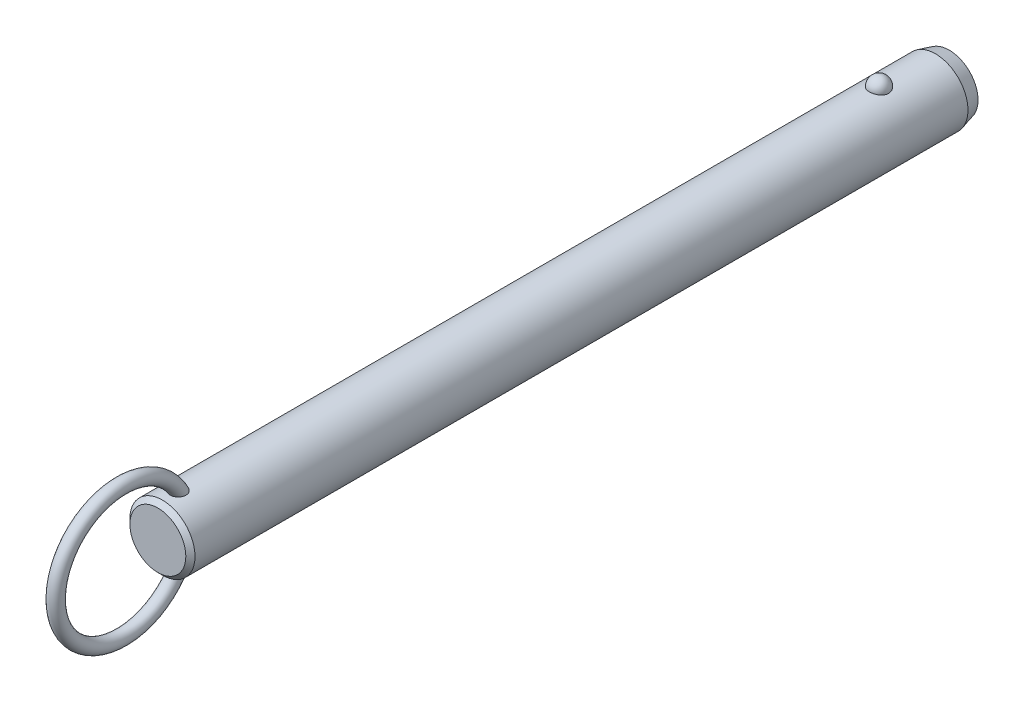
ISO-10303-21;
HEADER;
FILE_DESCRIPTION(('STEP AP214'),'2;1');
FILE_NAME('part.step','',(''),(''),'','','');
FILE_SCHEMA(('AUTOMOTIVE_DESIGN { 1 0 10303 214 1 1 1 1 }'));
ENDSEC;
DATA;
#1=APPLICATION_CONTEXT('core data for automotive mechanical design processes');
#2=APPLICATION_PROTOCOL_DEFINITION('international standard','automotive_design',2000,#1);
#3=PRODUCT_CONTEXT('',#1,'mechanical');
#4=PRODUCT('Part','Part','',(#3));
#5=PRODUCT_RELATED_PRODUCT_CATEGORY('part','',(#4));
#6=PRODUCT_DEFINITION_FORMATION('','',#4);
#7=PRODUCT_DEFINITION_CONTEXT('part definition',#1,'design');
#8=PRODUCT_DEFINITION('design','',#6,#7);
#9=PRODUCT_DEFINITION_SHAPE('','',#8);
#10=(LENGTH_UNIT() NAMED_UNIT(*) SI_UNIT(.MILLI.,.METRE.));
#11=(NAMED_UNIT(*) PLANE_ANGLE_UNIT() SI_UNIT($,.RADIAN.));
#12=(NAMED_UNIT(*) SI_UNIT($,.STERADIAN.) SOLID_ANGLE_UNIT());
#13=UNCERTAINTY_MEASURE_WITH_UNIT(LENGTH_MEASURE(1.E-05),#10,'distance_accuracy_value','');
#14=(GEOMETRIC_REPRESENTATION_CONTEXT(3) GLOBAL_UNCERTAINTY_ASSIGNED_CONTEXT((#13)) GLOBAL_UNIT_ASSIGNED_CONTEXT((#10,
#11,#12)) REPRESENTATION_CONTEXT('',''));
#15=CARTESIAN_POINT('',(0.,0.,0.));
#16=DIRECTION('',(0.,0.,1.));
#17=DIRECTION('',(1.,0.,0.));
#18=AXIS2_PLACEMENT_3D('',#15,#16,#17);
#19=CARTESIAN_POINT('',(0.,0.,147.3));
#20=DIRECTION('',(0.,0.,-1.));
#21=DIRECTION('',(-1.,0.,0.));
#22=AXIS2_PLACEMENT_3D('',#19,#20,#21);
#23=CYLINDRICAL_SURFACE('',#22,7.1);
#24=CARTESIAN_POINT('',(2.0769088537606,6.78943661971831,-2.1));
#25=CARTESIAN_POINT('',(2.07690739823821,6.78943796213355,-1.98268154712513));
#26=CARTESIAN_POINT('',(2.06738130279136,6.79237331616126,-1.86534506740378));
#27=CARTESIAN_POINT('',(2.0295040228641,6.8037853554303,-1.63400788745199));
#28=CARTESIAN_POINT('',(2.00114757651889,6.81226358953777,-1.52000812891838));
#29=CARTESIAN_POINT('',(1.92632025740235,6.83379798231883,-1.29863433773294));
#30=CARTESIAN_POINT('',(1.87985726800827,6.84685214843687,-1.19125744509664));
#31=CARTESIAN_POINT('',(1.76995205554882,6.87608091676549,-0.98604657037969));
#32=CARTESIAN_POINT('',(1.70650980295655,6.8922555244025,-0.88821260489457));
#33=CARTESIAN_POINT('',(1.5638119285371,6.92602930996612,-0.704242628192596));
#34=CARTESIAN_POINT('',(1.4844714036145,6.94363582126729,-0.618173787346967));
#35=CARTESIAN_POINT('',(1.31221746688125,6.97823658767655,-0.460740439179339));
#36=CARTESIAN_POINT('',(1.21930409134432,6.99523084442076,-0.389375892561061));
#37=CARTESIAN_POINT('',(1.02268781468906,7.02666176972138,-0.263547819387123));
#38=CARTESIAN_POINT('',(0.91902009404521,7.04110638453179,-0.209031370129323));
#39=CARTESIAN_POINT('',(0.703548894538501,7.06588726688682,-0.118163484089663));
#40=CARTESIAN_POINT('',(0.591746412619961,7.07622403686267,-0.0818098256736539));
#41=CARTESIAN_POINT('',(0.365557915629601,7.09147068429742,-0.0288711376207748));
#42=CARTESIAN_POINT('',(0.251267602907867,7.09648447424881,-0.0119070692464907));
#43=CARTESIAN_POINT('',(0.0213499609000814,7.10089837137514,0.00304925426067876));
#44=CARTESIAN_POINT('',(-0.0942772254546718,7.10029907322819,0.00104351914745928));
#45=CARTESIAN_POINT('',(-0.321651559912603,7.09360829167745,-0.0216931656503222));
#46=CARTESIAN_POINT('',(-0.433431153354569,7.08760388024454,-0.0421272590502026));
#47=CARTESIAN_POINT('',(-0.651862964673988,7.07086131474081,-0.100729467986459));
#48=CARTESIAN_POINT('',(-0.758515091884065,7.06012307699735,-0.138897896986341));
#49=CARTESIAN_POINT('',(-0.964449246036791,7.03496097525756,-0.232213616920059));
#50=CARTESIAN_POINT('',(-1.06368095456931,7.02051445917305,-0.287465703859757));
#51=CARTESIAN_POINT('',(-1.25145353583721,6.98948740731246,-0.413383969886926));
#52=CARTESIAN_POINT('',(-1.33999321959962,6.97290663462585,-0.48405186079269));
#53=CARTESIAN_POINT('',(-1.50591604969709,6.93898770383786,-0.640594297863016));
#54=CARTESIAN_POINT('',(-1.58302488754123,6.92164094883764,-0.726757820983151));
#55=CARTESIAN_POINT('',(-1.72189320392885,6.8884103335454,-0.91092752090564));
#56=CARTESIAN_POINT('',(-1.78365144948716,6.87252659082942,-1.008934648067));
#57=CARTESIAN_POINT('',(-1.89101272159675,6.84377189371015,-1.21549497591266));
#58=CARTESIAN_POINT('',(-1.93639553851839,6.83094274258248,-1.32416860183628));
#59=CARTESIAN_POINT('',(-2.00874275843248,6.81002070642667,-1.54791500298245));
#60=CARTESIAN_POINT('',(-2.03570774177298,6.80192767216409,-1.66298757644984));
#61=CARTESIAN_POINT('',(-2.07047276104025,6.7914266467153,-1.89571453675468));
#62=CARTESIAN_POINT('',(-2.07835878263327,6.78899315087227,-2.01335491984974));
#63=CARTESIAN_POINT('',(-2.07502083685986,6.79001409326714,-2.24833570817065));
#64=CARTESIAN_POINT('',(-2.06379746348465,6.7934683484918,-2.36567612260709));
#65=CARTESIAN_POINT('',(-2.02263913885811,6.80583442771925,-2.59603194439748));
#66=CARTESIAN_POINT('',(-1.99281127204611,6.81471501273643,-2.70906820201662));
#67=CARTESIAN_POINT('',(-1.91526639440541,6.83691232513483,-2.92836575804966));
#68=CARTESIAN_POINT('',(-1.8675486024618,6.85022924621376,-3.03462676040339));
#69=CARTESIAN_POINT('',(-1.75504492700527,6.87991336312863,-3.23806487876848));
#70=CARTESIAN_POINT('',(-1.69015924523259,6.89629822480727,-3.33518422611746));
#71=CARTESIAN_POINT('',(-1.54505404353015,6.93024852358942,-3.51697105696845));
#72=CARTESIAN_POINT('',(-1.46483385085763,6.94781401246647,-3.60163799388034));
#73=CARTESIAN_POINT('',(-1.29071406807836,6.98225977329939,-3.75654119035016));
#74=CARTESIAN_POINT('',(-1.19675650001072,6.99913673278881,-3.82671308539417));
#75=CARTESIAN_POINT('',(-0.997940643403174,7.03023618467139,-3.9501837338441));
#76=CARTESIAN_POINT('',(-0.89308318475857,7.04445887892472,-4.00348377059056));
#77=CARTESIAN_POINT('',(-0.676902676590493,7.06848365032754,-4.09107242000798));
#78=CARTESIAN_POINT('',(-0.565686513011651,7.0783430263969,-4.12560889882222));
#79=CARTESIAN_POINT('',(-0.338739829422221,7.09282534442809,-4.17575450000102));
#80=CARTESIAN_POINT('',(-0.223009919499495,7.09744899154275,-4.19136617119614));
#81=CARTESIAN_POINT('',(0.00707628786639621,7.10090930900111,-4.20307965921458));
#82=CARTESIAN_POINT('',(0.121410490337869,7.09986531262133,-4.19958377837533));
#83=CARTESIAN_POINT('',(0.347815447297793,7.092380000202,-4.17411564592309));
#84=CARTESIAN_POINT('',(0.459886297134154,7.08593891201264,-4.15214417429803));
#85=CARTESIAN_POINT('',(0.678084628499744,7.06838983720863,-4.09049562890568));
#86=CARTESIAN_POINT('',(0.784237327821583,7.05730369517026,-4.05090137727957));
#87=CARTESIAN_POINT('',(0.988305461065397,7.03163139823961,-3.95511447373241));
#88=CARTESIAN_POINT('',(1.08622031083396,7.01704499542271,-3.89892064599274));
#89=CARTESIAN_POINT('',(1.27284490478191,6.98562668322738,-3.77035541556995));
#90=CARTESIAN_POINT('',(1.36137372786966,6.96876135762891,-3.69772964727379));
#91=CARTESIAN_POINT('',(1.52509486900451,6.93477412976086,-3.53878279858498));
#92=CARTESIAN_POINT('',(1.60028496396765,6.91765218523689,-3.45245943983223));
#93=CARTESIAN_POINT('',(1.73681688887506,6.88465753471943,-3.26658774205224));
#94=CARTESIAN_POINT('',(1.79785966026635,6.86881574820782,-3.16681408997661));
#95=CARTESIAN_POINT('',(1.90265327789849,6.84053157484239,-2.95814408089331));
#96=CARTESIAN_POINT('',(1.94640861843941,6.82808830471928,-2.84925010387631));
#97=CARTESIAN_POINT('',(2.01274378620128,6.80881460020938,-2.63454318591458));
#98=CARTESIAN_POINT('',(2.03676193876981,6.80160856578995,-2.52920574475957));
#99=CARTESIAN_POINT('',(2.06884490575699,6.79191902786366,-2.3159172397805));
#100=CARTESIAN_POINT('',(2.07691019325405,6.78943538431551,-2.20796625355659));
#101=CARTESIAN_POINT('',(2.0769088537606,6.78943661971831,-2.1));
#102=B_SPLINE_CURVE_WITH_KNOTS('',3,(#24,#25,#26,#27,#28,#29,#30,#31,#32,#33,#34,#35,#36,#37,
#38,#39,#40,#41,#42,#43,#44,#45,#46,#47,#48,#49,#50,#51,#52,#53,#54,#55,#56,#57,#58,#59,#60,#61,
#62,#63,#64,#65,#66,#67,#68,#69,#70,#71,#72,#73,#74,#75,#76,#77,#78,#79,#80,#81,#82,#83,#84,#85,
#86,#87,#88,#89,#90,#91,#92,#93,#94,#95,#96,#97,#98,#99,#100,#101),.UNSPECIFIED.,.T.,.F.,(4,2,2,
2,2,2,2,2,2,2,2,2,2,2,2,2,2,2,2,2,2,2,2,2,2,2,2,2,2,2,2,2,2,2,2,2,2,2,4),(0.,0.351568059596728,
0.703234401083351,1.05474780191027,1.40626181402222,1.75970563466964,2.11314851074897,
2.4654696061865,2.81774759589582,3.16301449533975,3.50824481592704,3.84801136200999,
4.18778391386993,4.52968352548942,4.87162112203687,5.22076181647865,5.56993054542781,
5.92363364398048,6.27732559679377,6.62942052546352,6.98150450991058,7.33158042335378,
7.68167162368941,8.03384443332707,8.38603269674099,8.73975272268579,9.09344583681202,
9.44234545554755,9.79119807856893,10.1327344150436,10.4742563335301,10.8141898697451,
11.1541474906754,11.4997793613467,11.8454687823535,12.1979079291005,12.5502553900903,
12.8738073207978,13.1973496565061),.UNSPECIFIED.);
#103=CARTESIAN_POINT('',(2.0769088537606,6.78943661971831,-2.1));
#104=VERTEX_POINT('',#103);
#105=EDGE_CURVE('E41',#104,#104,#102,.T.);
#106=ORIENTED_EDGE('',*,*,#105,.T.);
#107=EDGE_LOOP('',(#106));
#108=FACE_BOUND('',#107,.T.);
#109=CARTESIAN_POINT('',(0.,0.,154.22));
#110=DIRECTION('',(0.,0.,1.));
#111=DIRECTION('',(1.,0.,0.));
#112=AXIS2_PLACEMENT_3D('',#109,#110,#111);
#113=CIRCLE('',#112,7.1);
#114=CARTESIAN_POINT('',(7.1,0.,154.22));
#115=VERTEX_POINT('',#114);
#116=EDGE_CURVE('E10',#115,#115,#113,.F.);
#117=ORIENTED_EDGE('',*,*,#116,.T.);
#118=EDGE_LOOP('',(#117));
#119=FACE_BOUND('',#118,.T.);
#120=CARTESIAN_POINT('',(-0.429539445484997,-7.08699541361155,149.042921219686));
#121=CARTESIAN_POINT('',(-0.508331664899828,-7.08221999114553,149.066876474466));
#122=CARTESIAN_POINT('',(-0.585039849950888,-7.07624016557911,149.097457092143));
#123=CARTESIAN_POINT('',(-0.73208265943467,-7.06254296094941,149.171024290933));
#124=CARTESIAN_POINT('',(-0.802417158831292,-7.05482554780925,149.214011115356));
#125=CARTESIAN_POINT('',(-0.934722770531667,-7.03851844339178,149.311113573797));
#126=CARTESIAN_POINT('',(-0.996700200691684,-7.02992941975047,149.365220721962));
#127=CARTESIAN_POINT('',(-1.11079942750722,-7.01280697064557,149.482967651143));
#128=CARTESIAN_POINT('',(-1.16292136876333,-7.00427354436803,149.546607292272));
#129=CARTESIAN_POINT('',(-1.25705660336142,-6.98799959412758,149.682687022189));
#130=CARTESIAN_POINT('',(-1.29888032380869,-6.98027525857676,149.755259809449));
#131=CARTESIAN_POINT('',(-1.37069920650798,-6.96652886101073,149.906168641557));
#132=CARTESIAN_POINT('',(-1.40069157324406,-6.96050720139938,149.984506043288));
#133=CARTESIAN_POINT('',(-1.45043507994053,-6.95031881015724,150.150190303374));
#134=CARTESIAN_POINT('',(-1.46937115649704,-6.94630231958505,150.237789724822));
#135=CARTESIAN_POINT('',(-1.49424917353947,-6.94099239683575,150.414871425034));
#136=CARTESIAN_POINT('',(-1.50018601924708,-6.93970003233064,150.504354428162));
#137=CARTESIAN_POINT('',(-1.49978214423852,-6.93978815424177,150.694060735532));
#138=CARTESIAN_POINT('',(-1.49187639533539,-6.94150934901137,150.794279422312));
#139=CARTESIAN_POINT('',(-1.46177925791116,-6.94790814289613,150.992479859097));
#140=CARTESIAN_POINT('',(-1.43957541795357,-6.95258831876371,151.090459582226));
#141=CARTESIAN_POINT('',(-1.37783293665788,-6.96510647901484,151.29536292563));
#142=CARTESIAN_POINT('',(-1.33634073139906,-6.97328848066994,151.401680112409));
#143=CARTESIAN_POINT('',(-1.23686994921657,-6.99161706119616,151.606177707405));
#144=CARTESIAN_POINT('',(-1.17889192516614,-7.00176357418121,151.704358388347));
#145=CARTESIAN_POINT('',(-1.0587512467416,-7.02082898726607,151.872374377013));
#146=CARTESIAN_POINT('',(-0.999247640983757,-7.02963746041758,151.944123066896));
#147=CARTESIAN_POINT('',(-0.869494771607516,-7.04686074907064,152.077195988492));
#148=CARTESIAN_POINT('',(-0.799263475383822,-7.05527619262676,152.138537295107));
#149=CARTESIAN_POINT('',(-0.665408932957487,-7.06899457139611,152.235131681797));
#150=CARTESIAN_POINT('',(-0.603817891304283,-7.07457275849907,152.273151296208));
#151=CARTESIAN_POINT('',(-0.475172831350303,-7.08437420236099,152.338758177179));
#152=CARTESIAN_POINT('',(-0.408123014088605,-7.08859848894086,152.366353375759));
#153=CARTESIAN_POINT('',(-0.269431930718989,-7.09522749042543,152.409256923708));
#154=CARTESIAN_POINT('',(-0.197757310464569,-7.09761688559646,152.424461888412));
#155=CARTESIAN_POINT('',(-0.0527849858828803,-7.10017268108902,152.440716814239));
#156=CARTESIAN_POINT('',(0.0205115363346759,-7.10034065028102,152.441776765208));
#157=CARTESIAN_POINT('',(0.156426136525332,-7.09855986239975,152.430461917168));
#158=CARTESIAN_POINT('',(0.219199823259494,-7.09688191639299,152.419806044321));
#159=CARTESIAN_POINT('',(0.342134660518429,-7.09201880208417,152.388537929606));
#160=CARTESIAN_POINT('',(0.402295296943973,-7.08883333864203,152.367923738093));
#161=CARTESIAN_POINT('',(0.520687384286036,-7.08113868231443,152.317212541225));
#162=CARTESIAN_POINT('',(0.578791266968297,-7.07658958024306,152.286827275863));
#163=CARTESIAN_POINT('',(0.690173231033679,-7.06659708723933,152.218367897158));
#164=CARTESIAN_POINT('',(0.743447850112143,-7.061153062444,152.180288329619));
#165=CARTESIAN_POINT('',(0.870947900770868,-7.04680292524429,152.076592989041));
#166=CARTESIAN_POINT('',(0.941828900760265,-7.03755800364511,152.006897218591));
#167=CARTESIAN_POINT('',(1.07136606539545,-7.01900793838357,151.856945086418));
#168=CARTESIAN_POINT('',(1.13000013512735,-7.00970271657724,151.776670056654));
#169=CARTESIAN_POINT('',(1.23579584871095,-6.99183327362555,151.606899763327));
#170=CARTESIAN_POINT('',(1.28274271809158,-6.98328455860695,151.517269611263));
#171=CARTESIAN_POINT('',(1.36351442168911,-6.96796352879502,151.332176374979));
#172=CARTESIAN_POINT('',(1.39733971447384,-6.96119115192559,151.236713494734));
#173=CARTESIAN_POINT('',(1.45579181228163,-6.94922464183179,151.02530928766));
#174=CARTESIAN_POINT('',(1.47790145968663,-6.94449000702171,150.908631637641));
#175=CARTESIAN_POINT('',(1.50168752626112,-6.93938731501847,150.673015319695));
#176=CARTESIAN_POINT('',(1.50336085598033,-6.93901991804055,150.55407631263));
#177=CARTESIAN_POINT('',(1.48486516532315,-6.9430010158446,150.32360799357));
#178=CARTESIAN_POINT('',(1.46573441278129,-6.9471253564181,150.211995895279));
#179=CARTESIAN_POINT('',(1.40606892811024,-6.95944667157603,149.994886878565));
#180=CARTESIAN_POINT('',(1.36556446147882,-6.96763788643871,149.8893815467));
#181=CARTESIAN_POINT('',(1.2708270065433,-6.98548038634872,149.704287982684));
#182=CARTESIAN_POINT('',(1.21949810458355,-6.99473841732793,149.623171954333));
#183=CARTESIAN_POINT('',(1.10242050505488,-7.01414069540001,149.472227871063));
#184=CARTESIAN_POINT('',(1.03668119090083,-7.02428436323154,149.40239252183));
#185=CARTESIAN_POINT('',(0.900559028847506,-7.04295285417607,149.283573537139));
#186=CARTESIAN_POINT('',(0.831428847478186,-7.05153466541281,149.233157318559));
#187=CARTESIAN_POINT('',(0.685291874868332,-7.06723150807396,149.145142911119));
#188=CARTESIAN_POINT('',(0.608287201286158,-7.07434693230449,149.107541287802));
#189=CARTESIAN_POINT('',(0.451878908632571,-7.08602232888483,149.047491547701));
#190=CARTESIAN_POINT('',(0.372686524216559,-7.09067127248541,149.024508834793));
#191=CARTESIAN_POINT('',(0.21147739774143,-7.09730788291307,148.992035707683));
#192=CARTESIAN_POINT('',(0.129460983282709,-7.09929585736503,148.98254373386));
#193=CARTESIAN_POINT('',(-0.0332905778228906,-7.10037858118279,148.977351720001));
#194=CARTESIAN_POINT('',(-0.114016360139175,-7.09953334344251,148.981365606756));
#195=CARTESIAN_POINT('',(-0.273670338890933,-7.09517338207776,149.002454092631));
#196=CARTESIAN_POINT('',(-0.352598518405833,-7.09165863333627,149.019528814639));
#197=CARTESIAN_POINT('',(-0.429539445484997,-7.08699541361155,149.042921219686));
#198=B_SPLINE_CURVE_WITH_KNOTS('',3,(#120,#121,#122,#123,#124,#125,#126,#127,#128,#129,#130,
#131,#132,#133,#134,#135,#136,#137,#138,#139,#140,#141,#142,#143,#144,#145,#146,#147,#148,#149,
#150,#151,#152,#153,#154,#155,#156,#157,#158,#159,#160,#161,#162,#163,#164,#165,#166,#167,#168,
#169,#170,#171,#172,#173,#174,#175,#176,#177,#178,#179,#180,#181,#182,#183,#184,#185,#186,#187,
#188,#189,#190,#191,#192,#193,#194,#195,#196,#197),.UNSPECIFIED.,.T.,.F.,(4,2,2,2,2,2,2,2,2,2,2,
2,2,2,2,2,2,2,2,2,2,2,2,2,2,2,2,2,2,2,2,2,2,2,2,2,2,2,4),(0.,0.247183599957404,
0.494372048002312,0.741372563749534,0.988369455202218,1.23962059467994,1.490931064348,
1.75897818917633,2.02713035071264,2.32758265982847,2.62829697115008,2.97008736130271,
3.31186629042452,3.59175319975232,3.87117637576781,4.08813841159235,4.30493502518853,
4.5235225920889,4.74195577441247,4.93215328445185,5.12238804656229,5.31884850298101,
5.51544871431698,5.81332317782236,6.11173048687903,6.41527266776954,6.71880423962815,
7.07358156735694,7.42841252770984,7.76631485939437,8.10373999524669,8.39142246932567,
8.67891817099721,8.93560332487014,9.19221962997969,9.43881106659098,9.68537399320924,
9.9267475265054,10.1681233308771),.UNSPECIFIED.);
#199=CARTESIAN_POINT('',(-0.429539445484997,-7.08699541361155,149.042921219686));
#200=VERTEX_POINT('',#199);
#201=EDGE_CURVE('E60',#200,#200,#198,.T.);
#202=ORIENTED_EDGE('',*,*,#201,.T.);
#203=EDGE_LOOP('',(#202));
#204=FACE_BOUND('',#203,.T.);
#205=CARTESIAN_POINT('',(-0.429539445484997,7.08699541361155,149.042921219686));
#206=CARTESIAN_POINT('',(-0.351665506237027,7.09171429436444,149.019246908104));
#207=CARTESIAN_POINT('',(-0.271733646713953,7.09525896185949,149.002036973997));
#208=CARTESIAN_POINT('',(-0.110026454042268,7.09960839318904,148.981005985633));
#209=CARTESIAN_POINT('',(-0.0282502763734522,7.10041187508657,148.977191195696));
#210=CARTESIAN_POINT('',(0.134782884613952,7.09918849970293,148.983059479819));
#211=CARTESIAN_POINT('',(0.216039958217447,7.09716214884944,148.99274013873));
#212=CARTESIAN_POINT('',(0.375730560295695,7.09050177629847,149.025347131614));
#213=CARTESIAN_POINT('',(0.454164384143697,7.08586802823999,149.048272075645));
#214=CARTESIAN_POINT('',(0.606025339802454,7.07449911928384,149.106771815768));
#215=CARTESIAN_POINT('',(0.67945100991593,7.06776334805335,149.142350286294));
#216=CARTESIAN_POINT('',(0.819234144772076,7.05292866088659,149.225175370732));
#217=CARTESIAN_POINT('',(0.88559181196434,7.04482978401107,149.272421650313));
#218=CARTESIAN_POINT('',(1.00993211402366,7.02808709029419,149.377590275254));
#219=CARTESIAN_POINT('',(1.06785399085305,7.01943990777,149.435583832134));
#220=CARTESIAN_POINT('',(1.17342527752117,7.00256662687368,149.560301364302));
#221=CARTESIAN_POINT('',(1.22107408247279,6.99434055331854,149.627025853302));
#222=CARTESIAN_POINT('',(1.30652927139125,6.97889183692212,149.769362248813));
#223=CARTESIAN_POINT('',(1.34399711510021,6.97170674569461,149.845180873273));
#224=CARTESIAN_POINT('',(1.40682616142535,6.95930080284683,150.001810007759));
#225=CARTESIAN_POINT('',(1.43218374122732,6.95408053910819,150.08262200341));
#226=CARTESIAN_POINT('',(1.47246409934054,6.94566853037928,150.253531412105));
#227=CARTESIAN_POINT('',(1.48642590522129,6.9426653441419,150.34386307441));
#228=CARTESIAN_POINT('',(1.5011410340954,6.93949744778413,150.525619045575));
#229=CARTESIAN_POINT('',(1.50188917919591,6.93933385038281,150.617043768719));
#230=CARTESIAN_POINT('',(1.49030464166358,6.94183245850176,150.81084381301));
#231=CARTESIAN_POINT('',(1.47627413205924,6.94486147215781,150.913112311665));
#232=CARTESIAN_POINT('',(1.43356351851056,6.95380194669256,151.114471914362));
#233=CARTESIAN_POINT('',(1.4048676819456,6.95971650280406,151.213559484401));
#234=CARTESIAN_POINT('',(1.32908750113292,6.97461208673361,151.418908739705));
#235=CARTESIAN_POINT('',(1.28011435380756,6.98388945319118,151.524456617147));
#236=CARTESIAN_POINT('',(1.16520357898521,7.00397743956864,151.725760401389));
#237=CARTESIAN_POINT('',(1.09927694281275,7.01478706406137,151.821522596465));
#238=CARTESIAN_POINT('',(0.969361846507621,7.03373936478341,151.976756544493));
#239=CARTESIAN_POINT('',(0.909042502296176,7.04187023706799,152.039303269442));
#240=CARTESIAN_POINT('',(0.779178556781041,7.05741732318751,152.154053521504));
#241=CARTESIAN_POINT('',(0.709649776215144,7.06483472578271,152.206274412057));
#242=CARTESIAN_POINT('',(0.576854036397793,7.0767751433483,152.288113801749));
#243=CARTESIAN_POINT('',(0.515118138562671,7.08158033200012,152.320164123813));
#244=CARTESIAN_POINT('',(0.387127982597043,7.08972701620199,152.373765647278));
#245=CARTESIAN_POINT('',(0.320877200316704,7.09306962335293,152.395324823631));
#246=CARTESIAN_POINT('',(0.185041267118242,7.09791507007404,152.426400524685));
#247=CARTESIAN_POINT('',(0.115437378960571,7.09940591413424,152.435838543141));
#248=CARTESIAN_POINT('',(-0.0243157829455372,7.10030171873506,152.441522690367));
#249=CARTESIAN_POINT('',(-0.0944648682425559,7.0997073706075,152.437773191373));
#250=CARTESIAN_POINT('',(-0.225713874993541,7.09668414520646,152.418508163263));
#251=CARTESIAN_POINT('',(-0.287006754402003,7.09444865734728,152.404232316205));
#252=CARTESIAN_POINT('',(-0.406555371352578,7.08860360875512,152.366368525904));
#253=CARTESIAN_POINT('',(-0.464809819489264,7.08499346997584,152.342776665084));
#254=CARTESIAN_POINT('',(-0.594955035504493,7.07541654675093,152.278923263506));
#255=CARTESIAN_POINT('',(-0.665389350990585,7.06906574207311,152.235753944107));
#256=CARTESIAN_POINT('',(-0.798242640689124,7.05530261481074,152.138587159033));
#257=CARTESIAN_POINT('',(-0.860645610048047,7.0478882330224,152.084568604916));
#258=CARTESIAN_POINT('',(-0.994249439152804,7.03045217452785,151.950996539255));
#259=CARTESIAN_POINT('',(-1.06260129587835,7.02030745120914,151.868614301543));
#260=CARTESIAN_POINT('',(-1.18502045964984,7.00068382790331,151.693843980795));
#261=CARTESIAN_POINT('',(-1.23907684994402,6.99120544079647,151.601448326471));
#262=CARTESIAN_POINT('',(-1.33335589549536,6.97384343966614,151.408008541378));
#263=CARTESIAN_POINT('',(-1.37336138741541,6.96598557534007,151.306856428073));
#264=CARTESIAN_POINT('',(-1.43770677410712,6.9529905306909,151.099504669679));
#265=CARTESIAN_POINT('',(-1.46204473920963,6.94785368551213,150.99330440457));
#266=CARTESIAN_POINT('',(-1.49537533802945,6.94076296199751,150.768231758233));
#267=CARTESIAN_POINT('',(-1.50273564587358,6.93914842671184,150.64909751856));
#268=CARTESIAN_POINT('',(-1.4954555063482,6.94072368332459,150.411470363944));
#269=CARTESIAN_POINT('',(-1.48082914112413,6.94391040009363,150.292977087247));
#270=CARTESIAN_POINT('',(-1.43076401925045,6.95438579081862,150.073432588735));
#271=CARTESIAN_POINT('',(-1.39762227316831,6.96121852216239,149.971841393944));
#272=CARTESIAN_POINT('',(-1.31211274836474,6.97783941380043,149.777351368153));
#273=CARTESIAN_POINT('',(-1.25976607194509,6.98762432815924,149.68444313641));
#274=CARTESIAN_POINT('',(-1.14583073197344,7.00713153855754,149.524160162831));
#275=CARTESIAN_POINT('',(-1.08665947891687,7.01665982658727,149.455035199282));
#276=CARTESIAN_POINT('',(-0.956606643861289,7.03556646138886,149.328878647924));
#277=CARTESIAN_POINT('',(-0.885737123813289,7.04494495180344,149.271834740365));
#278=CARTESIAN_POINT('',(-0.751558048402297,7.06035735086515,149.183100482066));
#279=CARTESIAN_POINT('',(-0.69012057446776,7.0666695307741,149.148593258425));
#280=CARTESIAN_POINT('',(-0.562815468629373,7.07794609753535,149.088750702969));
#281=CARTESIAN_POINT('',(-0.496948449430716,7.08291067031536,149.063414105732));
#282=CARTESIAN_POINT('',(-0.429539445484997,7.08699541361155,149.042921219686));
#283=B_SPLINE_CURVE_WITH_KNOTS('',3,(#205,#206,#207,#208,#209,#210,#211,#212,#213,#214,#215,
#216,#217,#218,#219,#220,#221,#222,#223,#224,#225,#226,#227,#228,#229,#230,#231,#232,#233,#234,
#235,#236,#237,#238,#239,#240,#241,#242,#243,#244,#245,#246,#247,#248,#249,#250,#251,#252,#253,
#254,#255,#256,#257,#258,#259,#260,#261,#262,#263,#264,#265,#266,#267,#268,#269,#270,#271,#272,
#273,#274,#275,#276,#277,#278,#279,#280,#281,#282),.UNSPECIFIED.,.T.,.F.,(4,2,2,2,2,2,2,2,2,2,2,
2,2,2,2,2,2,2,2,2,2,2,2,2,2,2,2,2,2,2,2,2,2,2,2,2,2,2,4),(0.,0.244335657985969,
0.488785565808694,0.733191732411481,0.977572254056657,1.2220237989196,1.46646834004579,
1.71259457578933,1.9587352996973,2.21226768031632,2.46587585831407,2.73913816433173,
3.01250754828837,3.32109936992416,3.63002293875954,3.9786351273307,4.32702187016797,
4.58793945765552,4.84841449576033,5.05676704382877,5.26496096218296,5.47449661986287,
5.68396281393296,5.87205447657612,6.06022532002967,6.30743751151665,6.55513496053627,
6.87602468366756,7.1971587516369,7.52305774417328,7.84899686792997,8.2051615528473,
8.56109821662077,8.88040084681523,9.19935367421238,9.47236282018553,9.74509220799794,
9.95662250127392,10.1681235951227),.UNSPECIFIED.);
#284=CARTESIAN_POINT('',(-0.429539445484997,7.08699541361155,149.042921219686));
#285=VERTEX_POINT('',#284);
#286=EDGE_CURVE('E67',#285,#285,#283,.T.);
#287=ORIENTED_EDGE('',*,*,#286,.T.);
#288=EDGE_LOOP('',(#287));
#289=FACE_BOUND('',#288,.T.);
#290=CARTESIAN_POINT('',(0.,0.,-14.4));
#291=DIRECTION('',(0.,0.,-1.));
#292=DIRECTION('',(-1.,0.,0.));
#293=AXIS2_PLACEMENT_3D('',#290,#291,#292);
#294=CIRCLE('',#293,7.1);
#295=CARTESIAN_POINT('',(-7.1,0.,-14.4));
#296=VERTEX_POINT('',#295);
#297=EDGE_CURVE('E57',#296,#296,#294,.F.);
#298=ORIENTED_EDGE('',*,*,#297,.T.);
#299=EDGE_LOOP('',(#298));
#300=FACE_BOUND('',#299,.T.);
#301=ADVANCED_FACE('F37',(#108,#119,#204,#289,#300),#23,.T.);
#302=CARTESIAN_POINT('',(0.,0.,-17.4));
#303=DIRECTION('',(0.,0.,-1.));
#304=DIRECTION('',(-1.,0.,0.));
#305=AXIS2_PLACEMENT_3D('',#302,#303,#304);
#306=PLANE('',#305);
#307=CARTESIAN_POINT('',(0.,0.,-17.4));
#308=DIRECTION('',(0.,0.,-1.));
#309=DIRECTION('',(-1.,0.,0.));
#310=AXIS2_PLACEMENT_3D('',#307,#308,#309);
#311=CIRCLE('',#310,6.29615242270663);
#312=CARTESIAN_POINT('',(-6.29615242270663,0.,-17.4));
#313=VERTEX_POINT('',#312);
#314=EDGE_CURVE('E66',#313,#313,#311,.T.);
#315=ORIENTED_EDGE('',*,*,#314,.T.);
#316=EDGE_LOOP('',(#315));
#317=FACE_BOUND('',#316,.T.);
#318=ADVANCED_FACE('F85',(#317),#306,.T.);
#319=CARTESIAN_POINT('',(0.,0.,-17.4));
#320=DIRECTION('',(0.,0.,1.));
#321=DIRECTION('',(1.,0.,0.));
#322=AXIS2_PLACEMENT_3D('',#319,#320,#321);
#323=CONICAL_SURFACE('',#322,6.29615242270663,0.261799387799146);
#324=ORIENTED_EDGE('',*,*,#297,.F.);
#325=EDGE_LOOP('',(#324));
#326=FACE_BOUND('',#325,.T.);
#327=ORIENTED_EDGE('',*,*,#314,.F.);
#328=EDGE_LOOP('',(#327));
#329=FACE_BOUND('',#328,.T.);
#330=ADVANCED_FACE('F83',(#326,#329),#323,.T.);
#331=CARTESIAN_POINT('',(0.,0.,155.22));
#332=DIRECTION('',(0.,0.,1.));
#333=DIRECTION('',(1.,0.,0.));
#334=AXIS2_PLACEMENT_3D('',#331,#332,#333);
#335=PLANE('',#334);
#336=CARTESIAN_POINT('',(0.,0.,155.22));
#337=DIRECTION('',(0.,0.,1.));
#338=DIRECTION('',(1.,0.,0.));
#339=AXIS2_PLACEMENT_3D('',#336,#337,#338);
#340=CIRCLE('',#339,6.09999999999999);
#341=CARTESIAN_POINT('',(6.09999999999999,0.,155.22));
#342=VERTEX_POINT('',#341);
#343=EDGE_CURVE('E50',#342,#342,#340,.T.);
#344=ORIENTED_EDGE('',*,*,#343,.T.);
#345=EDGE_LOOP('',(#344));
#346=FACE_BOUND('',#345,.T.);
#347=ADVANCED_FACE('F77',(#346),#335,.T.);
#348=CARTESIAN_POINT('',(0.,0.,163.15));
#349=DIRECTION('',(1.,0.,0.));
#350=DIRECTION('',(0.,0.,-1.));
#351=AXIS2_PLACEMENT_3D('',#348,#349,#350);
#352=TOROIDAL_SURFACE('',#351,14.35,1.5);
#353=ORIENTED_EDGE('',*,*,#286,.F.);
#354=EDGE_LOOP('',(#353));
#355=FACE_BOUND('',#354,.T.);
#356=ORIENTED_EDGE('',*,*,#201,.F.);
#357=EDGE_LOOP('',(#356));
#358=FACE_BOUND('',#357,.T.);
#359=ADVANCED_FACE('F73',(#355,#358),#352,.T.);
#360=CARTESIAN_POINT('',(0.,0.,155.22));
#361=DIRECTION('',(0.,0.,-1.));
#362=DIRECTION('',(-1.,0.,0.));
#363=AXIS2_PLACEMENT_3D('',#360,#361,#362);
#364=CONICAL_SURFACE('',#363,6.09999999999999,0.78539816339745);
#365=ORIENTED_EDGE('',*,*,#116,.F.);
#366=EDGE_LOOP('',(#365));
#367=FACE_BOUND('',#366,.T.);
#368=ORIENTED_EDGE('',*,*,#343,.F.);
#369=EDGE_LOOP('',(#368));
#370=FACE_BOUND('',#369,.T.);
#371=ADVANCED_FACE('F39',(#367,#370),#364,.T.);
#372=CARTESIAN_POINT('',(0.,7.1,-2.1));
#373=DIRECTION('',(0.,1.,0.));
#374=DIRECTION('',(0.,0.,1.));
#375=AXIS2_PLACEMENT_3D('',#372,#373,#374);
#376=SPHERICAL_SURFACE('',#375,2.10000000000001);
#377=ORIENTED_EDGE('',*,*,#105,.F.);
#378=EDGE_LOOP('',(#377));
#379=FACE_BOUND('',#378,.T.);
#380=ADVANCED_FACE('F79',(#379),#376,.T.);
#381=CLOSED_SHELL('',(#301,#318,#330,#347,#359,#371,#380));
#382=MANIFOLD_SOLID_BREP('B2',#381);
#383=ADVANCED_BREP_SHAPE_REPRESENTATION('',(#18,#382),#14);
#384=SHAPE_DEFINITION_REPRESENTATION(#9,#383);
ENDSEC;
END-ISO-10303-21;
